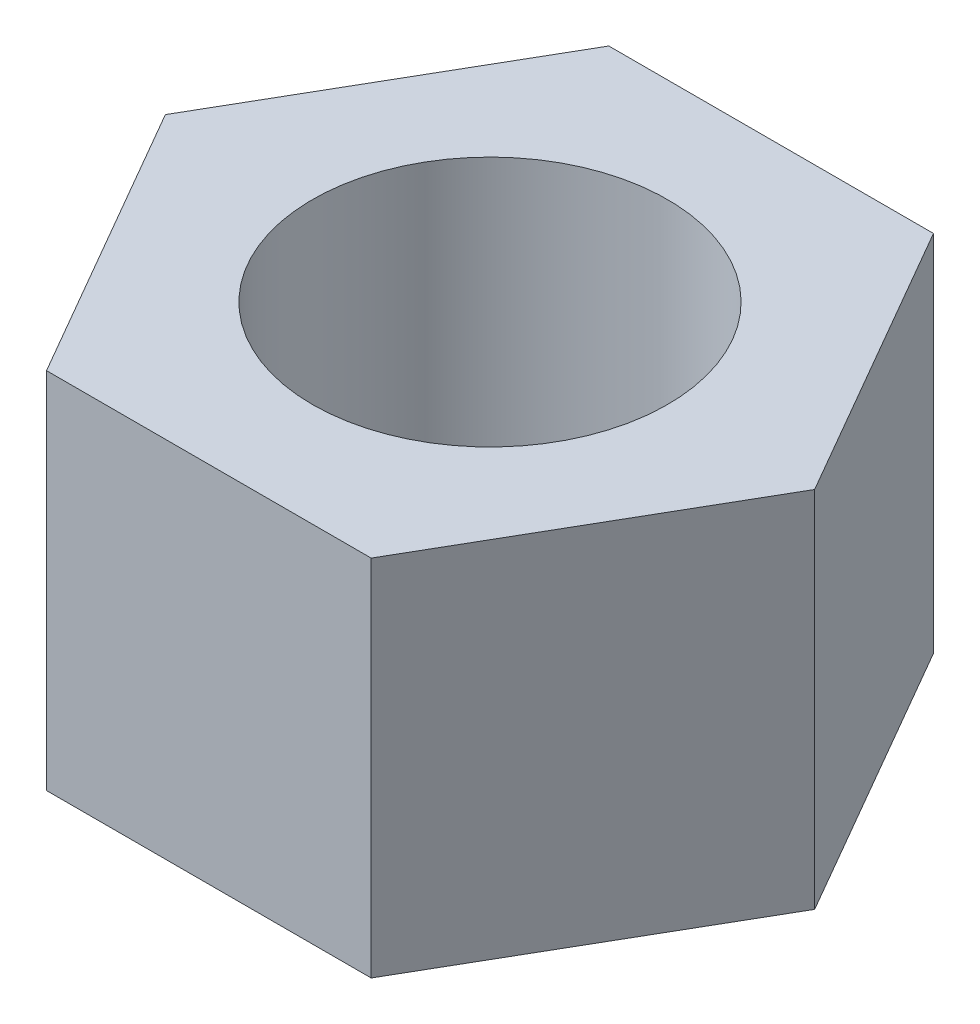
from build123d import *

# Parameters (mm, degrees)
BOSS_EXTRUDE1_DEPTH = 39.0144
SKETCH2_R           = 19.05
CUT_EXTRUDE1_DEPTH  = 101.6


with BuildPart() as part:
    # Sketch3 → Boss-Extrude1 (new body)
    with BuildSketch(Plane(origin=(0, 0, 0), x_dir=(1, 0, 0), z_dir=(0, 1, 0))):
        Polygon((17.414327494, -30.1625), (34.828654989, 0), (17.414327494, 30.1625), (-17.414327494, 30.1625), (-34.828654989, 0), (-17.414327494, -30.1625), align=None)
    extrude(amount=BOSS_EXTRUDE1_DEPTH)

    # Sketch2 → Cut-Extrude1 (cut)
    with BuildSketch(Plane(origin=(0, 0, 0), x_dir=(1, 0, 0), z_dir=(0, 1, 0))):
        with Locations(Location((0, 0, 0), (0, 0, 270))):
            Circle(SKETCH2_R)
    extrude(amount=CUT_EXTRUDE1_DEPTH, mode=Mode.SUBTRACT)


solid = part.part
